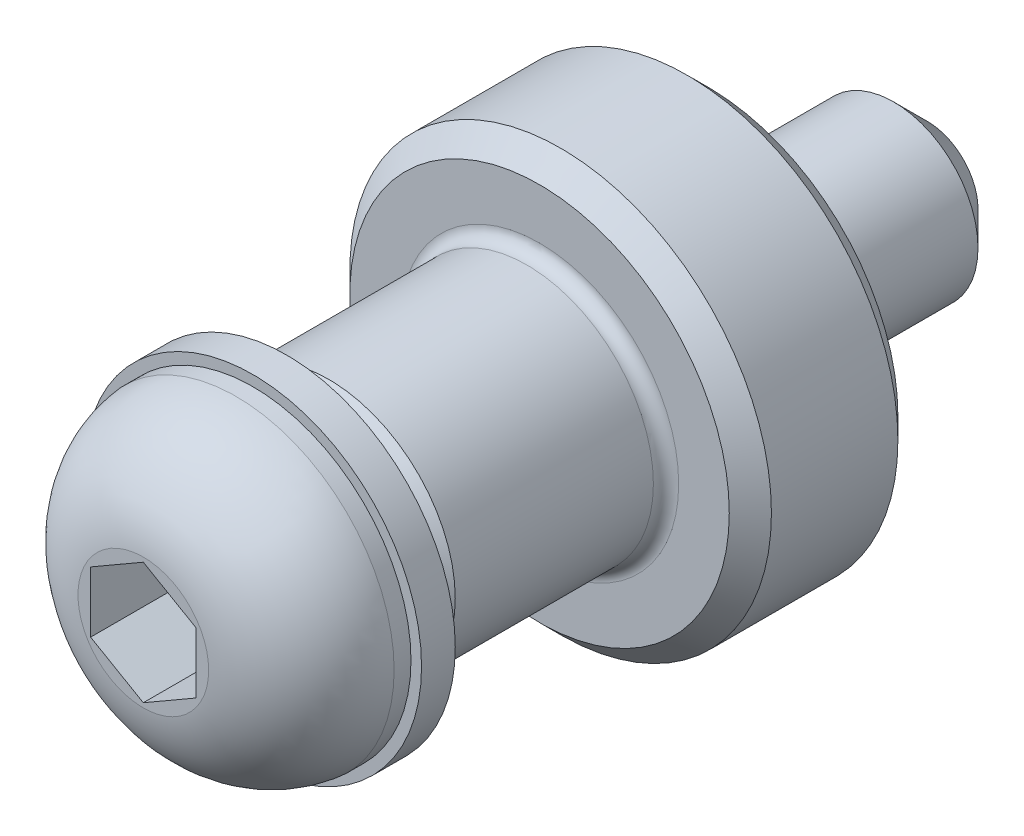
ISO-10303-21;
HEADER;
FILE_DESCRIPTION(('STEP AP214'),'2;1');
FILE_NAME('part.step','',(''),(''),'','','');
FILE_SCHEMA(('AUTOMOTIVE_DESIGN { 1 0 10303 214 1 1 1 1 }'));
ENDSEC;
DATA;
#1=APPLICATION_CONTEXT('core data for automotive mechanical design processes');
#2=APPLICATION_PROTOCOL_DEFINITION('international standard','automotive_design',2000,#1);
#3=PRODUCT_CONTEXT('',#1,'mechanical');
#4=PRODUCT('Part','Part','',(#3));
#5=PRODUCT_RELATED_PRODUCT_CATEGORY('part','',(#4));
#6=PRODUCT_DEFINITION_FORMATION('','',#4);
#7=PRODUCT_DEFINITION_CONTEXT('part definition',#1,'design');
#8=PRODUCT_DEFINITION('design','',#6,#7);
#9=PRODUCT_DEFINITION_SHAPE('','',#8);
#10=(LENGTH_UNIT() NAMED_UNIT(*) SI_UNIT(.MILLI.,.METRE.));
#11=(NAMED_UNIT(*) PLANE_ANGLE_UNIT() SI_UNIT($,.RADIAN.));
#12=(NAMED_UNIT(*) SI_UNIT($,.STERADIAN.) SOLID_ANGLE_UNIT());
#13=UNCERTAINTY_MEASURE_WITH_UNIT(LENGTH_MEASURE(1.E-05),#10,'distance_accuracy_value','');
#14=(GEOMETRIC_REPRESENTATION_CONTEXT(3) GLOBAL_UNCERTAINTY_ASSIGNED_CONTEXT((#13)) GLOBAL_UNIT_ASSIGNED_CONTEXT((#10,
#11,#12)) REPRESENTATION_CONTEXT('',''));
#15=CARTESIAN_POINT('',(0.,0.,0.));
#16=DIRECTION('',(0.,0.,1.));
#17=DIRECTION('',(1.,0.,0.));
#18=AXIS2_PLACEMENT_3D('',#15,#16,#17);
#19=CARTESIAN_POINT('',(0.,-4.30211422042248E-13,-5.2));
#20=DIRECTION('',(0.,0.,1.));
#21=DIRECTION('',(1.,0.,0.));
#22=AXIS2_PLACEMENT_3D('',#19,#20,#21);
#23=PLANE('',#22);
#24=CARTESIAN_POINT('',(0.,0.,-5.2));
#25=DIRECTION('',(0.,0.,1.));
#26=DIRECTION('',(1.,0.,0.));
#27=AXIS2_PLACEMENT_3D('',#24,#25,#26);
#28=CIRCLE('',#27,1.2);
#29=CARTESIAN_POINT('',(1.2,0.,-5.2));
#30=VERTEX_POINT('',#29);
#31=EDGE_CURVE('E129',#30,#30,#28,.T.);
#32=ORIENTED_EDGE('',*,*,#31,.F.);
#33=EDGE_LOOP('',(#32));
#34=FACE_BOUND('',#33,.T.);
#35=ADVANCED_FACE('F14',(#34),#23,.F.);
#36=CARTESIAN_POINT('',(0.,0.,-5.2));
#37=DIRECTION('',(0.,0.,1.));
#38=DIRECTION('',(1.,0.,0.));
#39=AXIS2_PLACEMENT_3D('',#36,#37,#38);
#40=CONICAL_SURFACE('',#39,1.2,0.785398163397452);
#41=CARTESIAN_POINT('',(0.,0.,-4.39999999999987));
#42=DIRECTION('',(0.,0.,1.));
#43=DIRECTION('',(1.,0.,0.));
#44=AXIS2_PLACEMENT_3D('',#41,#42,#43);
#45=CIRCLE('',#44,2.);
#46=CARTESIAN_POINT('',(2.,0.,-4.39999999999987));
#47=VERTEX_POINT('',#46);
#48=EDGE_CURVE('E126',#47,#47,#45,.T.);
#49=ORIENTED_EDGE('',*,*,#48,.F.);
#50=EDGE_LOOP('',(#49));
#51=FACE_BOUND('',#50,.T.);
#52=ORIENTED_EDGE('',*,*,#31,.T.);
#53=EDGE_LOOP('',(#52));
#54=FACE_BOUND('',#53,.T.);
#55=ADVANCED_FACE('F192',(#51,#54),#40,.T.);
#56=CARTESIAN_POINT('',(0.,0.,15.9));
#57=DIRECTION('',(0.,0.,1.));
#58=DIRECTION('',(1.,0.,0.));
#59=AXIS2_PLACEMENT_3D('',#56,#57,#58);
#60=CYLINDRICAL_SURFACE('',#59,2.);
#61=ORIENTED_EDGE('',*,*,#48,.T.);
#62=EDGE_LOOP('',(#61));
#63=FACE_BOUND('',#62,.T.);
#64=CARTESIAN_POINT('',(0.,0.,0.));
#65=DIRECTION('',(0.,0.,1.));
#66=DIRECTION('',(1.,0.,0.));
#67=AXIS2_PLACEMENT_3D('',#64,#65,#66);
#68=CIRCLE('',#67,2.);
#69=CARTESIAN_POINT('',(2.,0.,0.));
#70=VERTEX_POINT('',#69);
#71=EDGE_CURVE('E23',#70,#70,#68,.T.);
#72=ORIENTED_EDGE('',*,*,#71,.F.);
#73=EDGE_LOOP('',(#72));
#74=FACE_BOUND('',#73,.T.);
#75=ADVANCED_FACE('F234',(#63,#74),#60,.T.);
#76=CARTESIAN_POINT('',(0.,2.,10.));
#77=DIRECTION('',(0.,0.,1.));
#78=DIRECTION('',(1.,0.,0.));
#79=AXIS2_PLACEMENT_3D('',#76,#77,#78);
#80=PLANE('',#79);
#81=CARTESIAN_POINT('',(0.,0.,10.));
#82=DIRECTION('',(0.,0.,1.));
#83=DIRECTION('',(1.,0.,0.));
#84=AXIS2_PLACEMENT_3D('',#81,#82,#83);
#85=CIRCLE('',#84,3.99999999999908);
#86=CARTESIAN_POINT('',(3.99999999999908,0.,10.));
#87=VERTEX_POINT('',#86);
#88=EDGE_CURVE('E144',#87,#87,#85,.T.);
#89=ORIENTED_EDGE('',*,*,#88,.F.);
#90=EDGE_LOOP('',(#89));
#91=FACE_BOUND('',#90,.T.);
#92=CARTESIAN_POINT('',(0.,0.,10.));
#93=DIRECTION('',(0.,0.,1.));
#94=DIRECTION('',(1.,0.,0.));
#95=AXIS2_PLACEMENT_3D('',#92,#93,#94);
#96=CIRCLE('',#95,2.);
#97=CARTESIAN_POINT('',(2.,0.,10.));
#98=VERTEX_POINT('',#97);
#99=EDGE_CURVE('E118',#98,#98,#96,.T.);
#100=ORIENTED_EDGE('',*,*,#99,.T.);
#101=EDGE_LOOP('',(#100));
#102=FACE_BOUND('',#101,.T.);
#103=ADVANCED_FACE('F230',(#91,#102),#80,.F.);
#104=CARTESIAN_POINT('',(0.,0.,15.9));
#105=DIRECTION('',(0.,0.,1.));
#106=DIRECTION('',(1.,0.,0.));
#107=AXIS2_PLACEMENT_3D('',#104,#105,#106);
#108=CYLINDRICAL_SURFACE('',#107,3.99999999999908);
#109=CARTESIAN_POINT('',(0.,0.,10.8000000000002));
#110=DIRECTION('',(0.,0.,1.));
#111=DIRECTION('',(1.,0.,0.));
#112=AXIS2_PLACEMENT_3D('',#109,#110,#111);
#113=CIRCLE('',#112,3.99999999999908);
#114=CARTESIAN_POINT('',(3.99999999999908,0.,10.8000000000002));
#115=VERTEX_POINT('',#114);
#116=EDGE_CURVE('E141',#115,#115,#113,.T.);
#117=ORIENTED_EDGE('',*,*,#116,.F.);
#118=EDGE_LOOP('',(#117));
#119=FACE_BOUND('',#118,.T.);
#120=ORIENTED_EDGE('',*,*,#88,.T.);
#121=EDGE_LOOP('',(#120));
#122=FACE_BOUND('',#121,.T.);
#123=ADVANCED_FACE('F233',(#119,#122),#108,.T.);
#124=CARTESIAN_POINT('',(0.,3.75,10.8000000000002));
#125=DIRECTION('',(0.,0.,-1.));
#126=DIRECTION('',(-1.,0.,0.));
#127=AXIS2_PLACEMENT_3D('',#124,#125,#126);
#128=PLANE('',#127);
#129=CARTESIAN_POINT('',(0.,0.,10.8000000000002));
#130=DIRECTION('',(0.,0.,1.));
#131=DIRECTION('',(1.,0.,0.));
#132=AXIS2_PLACEMENT_3D('',#129,#130,#131);
#133=CIRCLE('',#132,3.75);
#134=CARTESIAN_POINT('',(3.75,0.,10.8000000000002));
#135=VERTEX_POINT('',#134);
#136=EDGE_CURVE('E138',#135,#135,#133,.T.);
#137=ORIENTED_EDGE('',*,*,#136,.F.);
#138=EDGE_LOOP('',(#137));
#139=FACE_BOUND('',#138,.T.);
#140=ORIENTED_EDGE('',*,*,#116,.T.);
#141=EDGE_LOOP('',(#140));
#142=FACE_BOUND('',#141,.T.);
#143=ADVANCED_FACE('F238',(#139,#142),#128,.F.);
#144=CARTESIAN_POINT('',(0.,0.,15.9));
#145=DIRECTION('',(0.,0.,1.));
#146=DIRECTION('',(1.,0.,0.));
#147=AXIS2_PLACEMENT_3D('',#144,#145,#146);
#148=CYLINDRICAL_SURFACE('',#147,3.75);
#149=CARTESIAN_POINT('',(0.,0.,11.1999999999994));
#150=DIRECTION('',(0.,0.,1.));
#151=DIRECTION('',(1.,0.,0.));
#152=AXIS2_PLACEMENT_3D('',#149,#150,#151);
#153=CIRCLE('',#152,3.75);
#154=CARTESIAN_POINT('',(3.75,0.,11.1999999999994));
#155=VERTEX_POINT('',#154);
#156=EDGE_CURVE('E135',#155,#155,#153,.T.);
#157=ORIENTED_EDGE('',*,*,#156,.F.);
#158=EDGE_LOOP('',(#157));
#159=FACE_BOUND('',#158,.T.);
#160=ORIENTED_EDGE('',*,*,#136,.T.);
#161=EDGE_LOOP('',(#160));
#162=FACE_BOUND('',#161,.T.);
#163=ADVANCED_FACE('F242',(#159,#162),#148,.T.);
#164=CARTESIAN_POINT('',(0.,0.,10.9161647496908));
#165=DIRECTION('',(0.,0.,1.));
#166=DIRECTION('',(1.,0.,0.));
#167=AXIS2_PLACEMENT_3D('',#164,#165,#166);
#168=DEGENERATE_TOROIDAL_SURFACE('',#167,1.26616474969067,2.49999999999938,.T.);
#169=CARTESIAN_POINT('',(0.,0.,13.4000000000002));
#170=DIRECTION('',(0.,0.,1.));
#171=DIRECTION('',(1.,0.,0.));
#172=AXIS2_PLACEMENT_3D('',#169,#170,#171);
#173=CIRCLE('',#172,1.54999999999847);
#174=CARTESIAN_POINT('',(1.54999999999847,0.,13.4000000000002));
#175=VERTEX_POINT('',#174);
#176=EDGE_CURVE('E132',#175,#175,#173,.T.);
#177=ORIENTED_EDGE('',*,*,#176,.F.);
#178=EDGE_LOOP('',(#177));
#179=FACE_BOUND('',#178,.T.);
#180=ORIENTED_EDGE('',*,*,#156,.T.);
#181=EDGE_LOOP('',(#180));
#182=FACE_BOUND('',#181,.T.);
#183=ADVANCED_FACE('F246',(#179,#182),#168,.T.);
#184=CARTESIAN_POINT('',(0.,1.54999999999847,13.4000000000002));
#185=DIRECTION('',(0.,0.,-1.));
#186=DIRECTION('',(-1.,0.,0.));
#187=AXIS2_PLACEMENT_3D('',#184,#185,#186);
#188=PLANE('',#187);
#189=DIRECTION('',(-0.866025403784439,-0.5,0.));
#190=VECTOR('',#189,1.);
#191=CARTESIAN_POINT('',(0.,1.44337567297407,13.4000000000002));
#192=LINE('',#191,#190);
#193=CARTESIAN_POINT('',(0.,1.44337567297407,13.4000000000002));
#194=VERTEX_POINT('',#193);
#195=CARTESIAN_POINT('',(-1.25,0.721687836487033,13.4000000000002));
#196=VERTEX_POINT('',#195);
#197=EDGE_CURVE('E105',#194,#196,#192,.T.);
#198=ORIENTED_EDGE('',*,*,#197,.F.);
#199=DIRECTION('',(-0.866025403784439,0.5,0.));
#200=VECTOR('',#199,1.);
#201=CARTESIAN_POINT('',(1.25,0.721687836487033,13.4000000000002));
#202=LINE('',#201,#200);
#203=CARTESIAN_POINT('',(1.25,0.721687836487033,13.4000000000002));
#204=VERTEX_POINT('',#203);
#205=EDGE_CURVE('E31',#204,#194,#202,.T.);
#206=ORIENTED_EDGE('',*,*,#205,.F.);
#207=DIRECTION('',(0.,1.,0.));
#208=VECTOR('',#207,1.);
#209=CARTESIAN_POINT('',(1.25,-0.721687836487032,13.4000000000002));
#210=LINE('',#209,#208);
#211=CARTESIAN_POINT('',(1.25,-0.721687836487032,13.4000000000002));
#212=VERTEX_POINT('',#211);
#213=EDGE_CURVE('E114',#212,#204,#210,.T.);
#214=ORIENTED_EDGE('',*,*,#213,.F.);
#215=DIRECTION('',(0.866025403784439,0.5,0.));
#216=VECTOR('',#215,1.);
#217=CARTESIAN_POINT('',(0.,-1.44337567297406,13.4000000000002));
#218=LINE('',#217,#216);
#219=CARTESIAN_POINT('',(0.,-1.44337567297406,13.4000000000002));
#220=VERTEX_POINT('',#219);
#221=EDGE_CURVE('E112',#220,#212,#218,.T.);
#222=ORIENTED_EDGE('',*,*,#221,.F.);
#223=DIRECTION('',(0.866025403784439,-0.5,0.));
#224=VECTOR('',#223,1.);
#225=CARTESIAN_POINT('',(-1.25,-0.721687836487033,13.4000000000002));
#226=LINE('',#225,#224);
#227=CARTESIAN_POINT('',(-1.25,-0.721687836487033,13.4000000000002));
#228=VERTEX_POINT('',#227);
#229=EDGE_CURVE('E79',#228,#220,#226,.T.);
#230=ORIENTED_EDGE('',*,*,#229,.F.);
#231=DIRECTION('',(0.,-1.,0.));
#232=VECTOR('',#231,1.);
#233=CARTESIAN_POINT('',(-1.25,0.721687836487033,13.4000000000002));
#234=LINE('',#233,#232);
#235=EDGE_CURVE('E108',#196,#228,#234,.T.);
#236=ORIENTED_EDGE('',*,*,#235,.F.);
#237=EDGE_LOOP('',(#198,#206,#214,#222,#230,#236));
#238=FACE_BOUND('',#237,.T.);
#239=ORIENTED_EDGE('',*,*,#176,.T.);
#240=EDGE_LOOP('',(#239));
#241=FACE_BOUND('',#240,.T.);
#242=ADVANCED_FACE('F250',(#238,#241),#188,.F.);
#243=CARTESIAN_POINT('',(0.,0.,9.5));
#244=DIRECTION('',(0.,0.,1.));
#245=DIRECTION('',(1.,0.,0.));
#246=AXIS2_PLACEMENT_3D('',#243,#244,#245);
#247=CIRCLE('',#246,2.);
#248=CARTESIAN_POINT('',(2.,0.,9.5));
#249=VERTEX_POINT('',#248);
#250=EDGE_CURVE('E9',#249,#249,#247,.T.);
#251=ORIENTED_EDGE('',*,*,#250,.T.);
#252=EDGE_LOOP('',(#251));
#253=FACE_BOUND('',#252,.T.);
#254=ORIENTED_EDGE('',*,*,#99,.F.);
#255=EDGE_LOOP('',(#254));
#256=FACE_BOUND('',#255,.T.);
#257=ADVANCED_FACE('F253',(#253,#256),#60,.T.);
#258=CARTESIAN_POINT('',(1.25,0.721687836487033,11.4000000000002));
#259=DIRECTION('',(0.5,0.866025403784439,0.));
#260=DIRECTION('',(-0.866025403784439,0.5,0.));
#261=AXIS2_PLACEMENT_3D('',#258,#259,#260);
#262=PLANE('',#261);
#263=ORIENTED_EDGE('',*,*,#205,.T.);
#264=DIRECTION('',(0.,0.,1.));
#265=VECTOR('',#264,1.);
#266=CARTESIAN_POINT('',(0.,1.44337567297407,11.4000000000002));
#267=LINE('',#266,#265);
#268=CARTESIAN_POINT('',(0.,1.44337567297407,11.4000000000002));
#269=VERTEX_POINT('',#268);
#270=EDGE_CURVE('E61',#269,#194,#267,.T.);
#271=ORIENTED_EDGE('',*,*,#270,.F.);
#272=DIRECTION('',(-0.866025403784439,0.5,0.));
#273=VECTOR('',#272,1.);
#274=CARTESIAN_POINT('',(1.25,0.721687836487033,11.4000000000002));
#275=LINE('',#274,#273);
#276=CARTESIAN_POINT('',(1.25,0.721687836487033,11.4000000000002));
#277=VERTEX_POINT('',#276);
#278=EDGE_CURVE('E116',#277,#269,#275,.T.);
#279=ORIENTED_EDGE('',*,*,#278,.F.);
#280=DIRECTION('',(0.,0.,1.));
#281=VECTOR('',#280,1.);
#282=CARTESIAN_POINT('',(1.25,0.721687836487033,11.4000000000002));
#283=LINE('',#282,#281);
#284=EDGE_CURVE('E39',#277,#204,#283,.T.);
#285=ORIENTED_EDGE('',*,*,#284,.T.);
#286=EDGE_LOOP('',(#263,#271,#279,#285));
#287=FACE_BOUND('',#286,.T.);
#288=ADVANCED_FACE('F261',(#287),#262,.F.);
#289=CARTESIAN_POINT('',(1.25,-0.721687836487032,11.4000000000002));
#290=DIRECTION('',(1.,0.,0.));
#291=DIRECTION('',(0.,0.,-1.));
#292=AXIS2_PLACEMENT_3D('',#289,#290,#291);
#293=PLANE('',#292);
#294=ORIENTED_EDGE('',*,*,#213,.T.);
#295=ORIENTED_EDGE('',*,*,#284,.F.);
#296=DIRECTION('',(0.,1.,0.));
#297=VECTOR('',#296,1.);
#298=CARTESIAN_POINT('',(1.25,-0.721687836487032,11.4000000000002));
#299=LINE('',#298,#297);
#300=CARTESIAN_POINT('',(1.25,-0.721687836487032,11.4000000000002));
#301=VERTEX_POINT('',#300);
#302=EDGE_CURVE('E91',#301,#277,#299,.T.);
#303=ORIENTED_EDGE('',*,*,#302,.F.);
#304=DIRECTION('',(0.,0.,1.));
#305=VECTOR('',#304,1.);
#306=CARTESIAN_POINT('',(1.25,-0.721687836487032,11.4000000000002));
#307=LINE('',#306,#305);
#308=EDGE_CURVE('E83',#301,#212,#307,.T.);
#309=ORIENTED_EDGE('',*,*,#308,.T.);
#310=EDGE_LOOP('',(#294,#295,#303,#309));
#311=FACE_BOUND('',#310,.T.);
#312=ADVANCED_FACE('F265',(#311),#293,.F.);
#313=CARTESIAN_POINT('',(0.,-1.44337567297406,11.4000000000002));
#314=DIRECTION('',(0.5,-0.866025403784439,0.));
#315=DIRECTION('',(0.866025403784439,0.5,0.));
#316=AXIS2_PLACEMENT_3D('',#313,#314,#315);
#317=PLANE('',#316);
#318=ORIENTED_EDGE('',*,*,#221,.T.);
#319=ORIENTED_EDGE('',*,*,#308,.F.);
#320=DIRECTION('',(0.866025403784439,0.5,0.));
#321=VECTOR('',#320,1.);
#322=CARTESIAN_POINT('',(0.,-1.44337567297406,11.4000000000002));
#323=LINE('',#322,#321);
#324=CARTESIAN_POINT('',(0.,-1.44337567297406,11.4000000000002));
#325=VERTEX_POINT('',#324);
#326=EDGE_CURVE('E87',#325,#301,#323,.T.);
#327=ORIENTED_EDGE('',*,*,#326,.F.);
#328=DIRECTION('',(0.,0.,1.));
#329=VECTOR('',#328,1.);
#330=CARTESIAN_POINT('',(0.,-1.44337567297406,11.4000000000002));
#331=LINE('',#330,#329);
#332=EDGE_CURVE('E72',#325,#220,#331,.T.);
#333=ORIENTED_EDGE('',*,*,#332,.T.);
#334=EDGE_LOOP('',(#318,#319,#327,#333));
#335=FACE_BOUND('',#334,.T.);
#336=ADVANCED_FACE('F88',(#335),#317,.F.);
#337=CARTESIAN_POINT('',(-1.25,-0.721687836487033,11.4000000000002));
#338=DIRECTION('',(-0.5,-0.866025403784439,0.));
#339=DIRECTION('',(0.866025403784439,-0.5,0.));
#340=AXIS2_PLACEMENT_3D('',#337,#338,#339);
#341=PLANE('',#340);
#342=ORIENTED_EDGE('',*,*,#229,.T.);
#343=ORIENTED_EDGE('',*,*,#332,.F.);
#344=DIRECTION('',(0.866025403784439,-0.5,0.));
#345=VECTOR('',#344,1.);
#346=CARTESIAN_POINT('',(-1.25,-0.721687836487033,11.4000000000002));
#347=LINE('',#346,#345);
#348=CARTESIAN_POINT('',(-1.25,-0.721687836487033,11.4000000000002));
#349=VERTEX_POINT('',#348);
#350=EDGE_CURVE('E76',#349,#325,#347,.T.);
#351=ORIENTED_EDGE('',*,*,#350,.F.);
#352=DIRECTION('',(0.,0.,1.));
#353=VECTOR('',#352,1.);
#354=CARTESIAN_POINT('',(-1.25,-0.721687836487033,11.4000000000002));
#355=LINE('',#354,#353);
#356=EDGE_CURVE('E84',#349,#228,#355,.T.);
#357=ORIENTED_EDGE('',*,*,#356,.T.);
#358=EDGE_LOOP('',(#342,#343,#351,#357));
#359=FACE_BOUND('',#358,.T.);
#360=ADVANCED_FACE('F74',(#359),#341,.F.);
#361=CARTESIAN_POINT('',(-1.25,0.721687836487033,11.4000000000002));
#362=DIRECTION('',(-1.,0.,0.));
#363=DIRECTION('',(0.,-1.,0.));
#364=AXIS2_PLACEMENT_3D('',#361,#362,#363);
#365=PLANE('',#364);
#366=ORIENTED_EDGE('',*,*,#235,.T.);
#367=ORIENTED_EDGE('',*,*,#356,.F.);
#368=DIRECTION('',(0.,-1.,0.));
#369=VECTOR('',#368,1.);
#370=CARTESIAN_POINT('',(-1.25,0.721687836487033,11.4000000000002));
#371=LINE('',#370,#369);
#372=CARTESIAN_POINT('',(-1.25,0.721687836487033,11.4000000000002));
#373=VERTEX_POINT('',#372);
#374=EDGE_CURVE('E97',#373,#349,#371,.T.);
#375=ORIENTED_EDGE('',*,*,#374,.F.);
#376=DIRECTION('',(0.,0.,1.));
#377=VECTOR('',#376,1.);
#378=CARTESIAN_POINT('',(-1.25,0.721687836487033,11.4000000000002));
#379=LINE('',#378,#377);
#380=EDGE_CURVE('E121',#373,#196,#379,.T.);
#381=ORIENTED_EDGE('',*,*,#380,.T.);
#382=EDGE_LOOP('',(#366,#367,#375,#381));
#383=FACE_BOUND('',#382,.T.);
#384=ADVANCED_FACE('F269',(#383),#365,.F.);
#385=CARTESIAN_POINT('',(0.,1.44337567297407,11.4000000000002));
#386=DIRECTION('',(-0.5,0.866025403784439,0.));
#387=DIRECTION('',(-0.866025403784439,-0.5,0.));
#388=AXIS2_PLACEMENT_3D('',#385,#386,#387);
#389=PLANE('',#388);
#390=ORIENTED_EDGE('',*,*,#197,.T.);
#391=ORIENTED_EDGE('',*,*,#380,.F.);
#392=DIRECTION('',(-0.866025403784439,-0.5,0.));
#393=VECTOR('',#392,1.);
#394=CARTESIAN_POINT('',(0.,1.44337567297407,11.4000000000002));
#395=LINE('',#394,#393);
#396=EDGE_CURVE('E99',#269,#373,#395,.T.);
#397=ORIENTED_EDGE('',*,*,#396,.F.);
#398=ORIENTED_EDGE('',*,*,#270,.T.);
#399=EDGE_LOOP('',(#390,#391,#397,#398));
#400=FACE_BOUND('',#399,.T.);
#401=ADVANCED_FACE('F266',(#400),#389,.F.);
#402=CARTESIAN_POINT('',(0.,1.44337567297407,11.4000000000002));
#403=DIRECTION('',(0.,0.,1.));
#404=DIRECTION('',(1.,0.,0.));
#405=AXIS2_PLACEMENT_3D('',#402,#403,#404);
#406=PLANE('',#405);
#407=ORIENTED_EDGE('',*,*,#278,.T.);
#408=ORIENTED_EDGE('',*,*,#396,.T.);
#409=ORIENTED_EDGE('',*,*,#374,.T.);
#410=ORIENTED_EDGE('',*,*,#350,.T.);
#411=ORIENTED_EDGE('',*,*,#326,.T.);
#412=ORIENTED_EDGE('',*,*,#302,.T.);
#413=EDGE_LOOP('',(#407,#408,#409,#410,#411,#412));
#414=FACE_BOUND('',#413,.T.);
#415=ADVANCED_FACE('F94',(#414),#406,.T.);
#416=CARTESIAN_POINT('',(0.,0.,4.));
#417=DIRECTION('',(0.,0.,1.));
#418=DIRECTION('',(1.,0.,0.));
#419=AXIS2_PLACEMENT_3D('',#416,#417,#418);
#420=PLANE('',#419);
#421=CARTESIAN_POINT('',(0.,0.,4.));
#422=DIRECTION('',(0.,0.,1.));
#423=DIRECTION('',(1.,0.,0.));
#424=AXIS2_PLACEMENT_3D('',#421,#422,#423);
#425=CIRCLE('',#424,4.5);
#426=CARTESIAN_POINT('',(4.5,0.,4.));
#427=VERTEX_POINT('',#426);
#428=EDGE_CURVE('E164',#427,#427,#425,.T.);
#429=ORIENTED_EDGE('',*,*,#428,.T.);
#430=EDGE_LOOP('',(#429));
#431=FACE_BOUND('',#430,.T.);
#432=CARTESIAN_POINT('',(0.,0.,4.));
#433=DIRECTION('',(0.,0.,1.));
#434=DIRECTION('',(1.,0.,0.));
#435=AXIS2_PLACEMENT_3D('',#432,#433,#434);
#436=CIRCLE('',#435,3.3);
#437=CARTESIAN_POINT('',(3.3,0.,4.));
#438=VERTEX_POINT('',#437);
#439=EDGE_CURVE('E152',#438,#438,#436,.F.);
#440=ORIENTED_EDGE('',*,*,#439,.T.);
#441=EDGE_LOOP('',(#440));
#442=FACE_BOUND('',#441,.T.);
#443=ADVANCED_FACE('F190',(#431,#442),#420,.T.);
#444=CARTESIAN_POINT('',(0.,0.,4.));
#445=DIRECTION('',(0.,0.,-1.));
#446=DIRECTION('',(-1.,0.,0.));
#447=AXIS2_PLACEMENT_3D('',#444,#445,#446);
#448=CONICAL_SURFACE('',#447,4.5,0.78539816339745);
#449=CARTESIAN_POINT('',(0.,0.,3.5));
#450=DIRECTION('',(0.,0.,1.));
#451=DIRECTION('',(1.,0.,0.));
#452=AXIS2_PLACEMENT_3D('',#449,#450,#451);
#453=CIRCLE('',#452,5.);
#454=CARTESIAN_POINT('',(5.,0.,3.5));
#455=VERTEX_POINT('',#454);
#456=EDGE_CURVE('E155',#455,#455,#453,.F.);
#457=ORIENTED_EDGE('',*,*,#456,.F.);
#458=EDGE_LOOP('',(#457));
#459=FACE_BOUND('',#458,.T.);
#460=ORIENTED_EDGE('',*,*,#428,.F.);
#461=EDGE_LOOP('',(#460));
#462=FACE_BOUND('',#461,.T.);
#463=ADVANCED_FACE('F179',(#459,#462),#448,.T.);
#464=CARTESIAN_POINT('',(0.,0.,9.5));
#465=DIRECTION('',(0.,0.,-1.));
#466=DIRECTION('',(-1.,0.,0.));
#467=AXIS2_PLACEMENT_3D('',#464,#465,#466);
#468=CYLINDRICAL_SURFACE('',#467,5.);
#469=CARTESIAN_POINT('',(0.,0.,0.5));
#470=DIRECTION('',(0.,0.,1.));
#471=DIRECTION('',(1.,0.,0.));
#472=AXIS2_PLACEMENT_3D('',#469,#470,#471);
#473=CIRCLE('',#472,5.);
#474=CARTESIAN_POINT('',(5.,0.,0.5));
#475=VERTEX_POINT('',#474);
#476=EDGE_CURVE('E158',#475,#475,#473,.T.);
#477=ORIENTED_EDGE('',*,*,#476,.T.);
#478=EDGE_LOOP('',(#477));
#479=FACE_BOUND('',#478,.T.);
#480=ORIENTED_EDGE('',*,*,#456,.T.);
#481=EDGE_LOOP('',(#480));
#482=FACE_BOUND('',#481,.T.);
#483=ADVANCED_FACE('F187',(#479,#482),#468,.T.);
#484=CARTESIAN_POINT('',(0.,0.,0.5));
#485=DIRECTION('',(0.,0.,1.));
#486=DIRECTION('',(1.,0.,0.));
#487=AXIS2_PLACEMENT_3D('',#484,#485,#486);
#488=CONICAL_SURFACE('',#487,5.,0.78539816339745);
#489=CARTESIAN_POINT('',(0.,0.,0.));
#490=DIRECTION('',(0.,0.,1.));
#491=DIRECTION('',(1.,0.,0.));
#492=AXIS2_PLACEMENT_3D('',#489,#490,#491);
#493=CIRCLE('',#492,4.5);
#494=CARTESIAN_POINT('',(4.5,0.,0.));
#495=VERTEX_POINT('',#494);
#496=EDGE_CURVE('E161',#495,#495,#493,.F.);
#497=ORIENTED_EDGE('',*,*,#496,.F.);
#498=EDGE_LOOP('',(#497));
#499=FACE_BOUND('',#498,.T.);
#500=ORIENTED_EDGE('',*,*,#476,.F.);
#501=EDGE_LOOP('',(#500));
#502=FACE_BOUND('',#501,.T.);
#503=ADVANCED_FACE('F197',(#499,#502),#488,.T.);
#504=CARTESIAN_POINT('',(0.,0.,0.));
#505=DIRECTION('',(0.,0.,1.));
#506=DIRECTION('',(1.,0.,0.));
#507=AXIS2_PLACEMENT_3D('',#504,#505,#506);
#508=PLANE('',#507);
#509=ORIENTED_EDGE('',*,*,#496,.T.);
#510=EDGE_LOOP('',(#509));
#511=FACE_BOUND('',#510,.T.);
#512=ORIENTED_EDGE('',*,*,#71,.T.);
#513=EDGE_LOOP('',(#512));
#514=FACE_BOUND('',#513,.T.);
#515=ADVANCED_FACE('F205',(#511,#514),#508,.F.);
#516=CARTESIAN_POINT('',(0.,0.,4.3));
#517=DIRECTION('',(0.,0.,1.));
#518=DIRECTION('',(1.,0.,0.));
#519=AXIS2_PLACEMENT_3D('',#516,#517,#518);
#520=TOROIDAL_SURFACE('',#519,3.3,0.3);
#521=ORIENTED_EDGE('',*,*,#439,.F.);
#522=EDGE_LOOP('',(#521));
#523=FACE_BOUND('',#522,.T.);
#524=CARTESIAN_POINT('',(0.,0.,4.3));
#525=DIRECTION('',(0.,0.,1.));
#526=DIRECTION('',(1.,0.,0.));
#527=AXIS2_PLACEMENT_3D('',#524,#525,#526);
#528=CIRCLE('',#527,3.);
#529=CARTESIAN_POINT('',(3.,0.,4.3));
#530=VERTEX_POINT('',#529);
#531=EDGE_CURVE('E149',#530,#530,#528,.T.);
#532=ORIENTED_EDGE('',*,*,#531,.F.);
#533=EDGE_LOOP('',(#532));
#534=FACE_BOUND('',#533,.T.);
#535=ADVANCED_FACE('F188',(#523,#534),#520,.F.);
#536=CARTESIAN_POINT('',(0.,0.,4.));
#537=DIRECTION('',(0.,0.,1.));
#538=DIRECTION('',(1.,0.,0.));
#539=AXIS2_PLACEMENT_3D('',#536,#537,#538);
#540=CYLINDRICAL_SURFACE('',#539,3.);
#541=CARTESIAN_POINT('',(0.,0.,9.));
#542=DIRECTION('',(0.,0.,1.));
#543=DIRECTION('',(1.,0.,0.));
#544=AXIS2_PLACEMENT_3D('',#541,#542,#543);
#545=CIRCLE('',#544,3.);
#546=CARTESIAN_POINT('',(3.,0.,9.));
#547=VERTEX_POINT('',#546);
#548=EDGE_CURVE('E18',#547,#547,#545,.F.);
#549=ORIENTED_EDGE('',*,*,#548,.T.);
#550=EDGE_LOOP('',(#549));
#551=FACE_BOUND('',#550,.T.);
#552=ORIENTED_EDGE('',*,*,#531,.T.);
#553=EDGE_LOOP('',(#552));
#554=FACE_BOUND('',#553,.T.);
#555=ADVANCED_FACE('F173',(#551,#554),#540,.T.);
#556=CARTESIAN_POINT('',(0.,0.,9.5));
#557=DIRECTION('',(0.,0.,-1.));
#558=DIRECTION('',(-1.,0.,0.));
#559=AXIS2_PLACEMENT_3D('',#556,#557,#558);
#560=CONICAL_SURFACE('',#559,2.5,0.785398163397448);
#561=ORIENTED_EDGE('',*,*,#548,.F.);
#562=EDGE_LOOP('',(#561));
#563=FACE_BOUND('',#562,.T.);
#564=CARTESIAN_POINT('',(0.,0.,9.5));
#565=DIRECTION('',(0.,0.,1.));
#566=DIRECTION('',(1.,0.,0.));
#567=AXIS2_PLACEMENT_3D('',#564,#565,#566);
#568=CIRCLE('',#567,2.5);
#569=CARTESIAN_POINT('',(2.5,0.,9.5));
#570=VERTEX_POINT('',#569);
#571=EDGE_CURVE('E166',#570,#570,#568,.T.);
#572=ORIENTED_EDGE('',*,*,#571,.F.);
#573=EDGE_LOOP('',(#572));
#574=FACE_BOUND('',#573,.T.);
#575=ADVANCED_FACE('F16',(#563,#574),#560,.T.);
#576=CARTESIAN_POINT('',(0.,0.,9.5));
#577=DIRECTION('',(0.,0.,1.));
#578=DIRECTION('',(1.,0.,0.));
#579=AXIS2_PLACEMENT_3D('',#576,#577,#578);
#580=PLANE('',#579);
#581=ORIENTED_EDGE('',*,*,#571,.T.);
#582=EDGE_LOOP('',(#581));
#583=FACE_BOUND('',#582,.T.);
#584=ORIENTED_EDGE('',*,*,#250,.F.);
#585=EDGE_LOOP('',(#584));
#586=FACE_BOUND('',#585,.T.);
#587=ADVANCED_FACE('F178',(#583,#586),#580,.T.);
#588=CLOSED_SHELL('',(#35,#55,#75,#103,#123,#143,#163,#183,#242,#257,#288,#312,#336,#360,#384,
#401,#415,#443,#463,#483,#503,#515,#535,#555,#575,#587));
#589=MANIFOLD_SOLID_BREP('B1',#588);
#590=ADVANCED_BREP_SHAPE_REPRESENTATION('',(#18,#589),#14);
#591=SHAPE_DEFINITION_REPRESENTATION(#9,#590);
ENDSEC;
END-ISO-10303-21;
